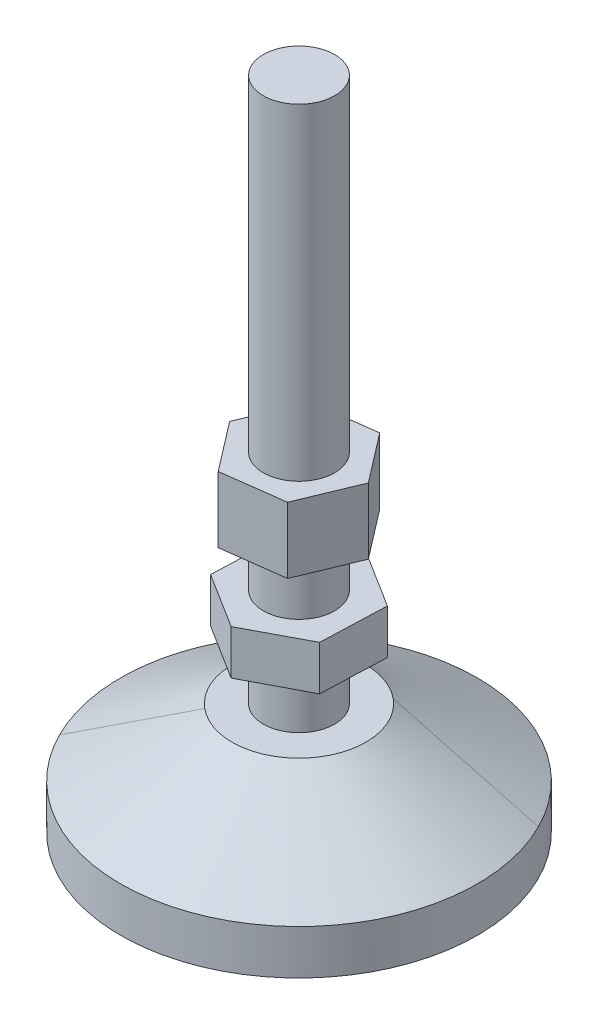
ISO-10303-21;
HEADER;
FILE_DESCRIPTION(('STEP AP214'),'2;1');
FILE_NAME('part.step','',(''),(''),'','','');
FILE_SCHEMA(('AUTOMOTIVE_DESIGN { 1 0 10303 214 1 1 1 1 }'));
ENDSEC;
DATA;
#1=APPLICATION_CONTEXT('core data for automotive mechanical design processes');
#2=APPLICATION_PROTOCOL_DEFINITION('international standard','automotive_design',2000,#1);
#3=PRODUCT_CONTEXT('',#1,'mechanical');
#4=PRODUCT('Part','Part','',(#3));
#5=PRODUCT_RELATED_PRODUCT_CATEGORY('part','',(#4));
#6=PRODUCT_DEFINITION_FORMATION('','',#4);
#7=PRODUCT_DEFINITION_CONTEXT('part definition',#1,'design');
#8=PRODUCT_DEFINITION('design','',#6,#7);
#9=PRODUCT_DEFINITION_SHAPE('','',#8);
#10=(LENGTH_UNIT() NAMED_UNIT(*) SI_UNIT(.MILLI.,.METRE.));
#11=(NAMED_UNIT(*) PLANE_ANGLE_UNIT() SI_UNIT($,.RADIAN.));
#12=(NAMED_UNIT(*) SI_UNIT($,.STERADIAN.) SOLID_ANGLE_UNIT());
#13=UNCERTAINTY_MEASURE_WITH_UNIT(LENGTH_MEASURE(1.E-05),#10,'distance_accuracy_value','');
#14=(GEOMETRIC_REPRESENTATION_CONTEXT(3) GLOBAL_UNCERTAINTY_ASSIGNED_CONTEXT((#13)) GLOBAL_UNIT_ASSIGNED_CONTEXT((#10,
#11,#12)) REPRESENTATION_CONTEXT('',''));
#15=CARTESIAN_POINT('',(0.,0.,0.));
#16=DIRECTION('',(0.,0.,1.));
#17=DIRECTION('',(1.,0.,0.));
#18=AXIS2_PLACEMENT_3D('',#15,#16,#17);
#19=CARTESIAN_POINT('',(0.,147.,0.));
#20=DIRECTION('',(0.,1.,0.));
#21=DIRECTION('',(0.,0.,-1.));
#22=AXIS2_PLACEMENT_3D('',#19,#20,#21);
#23=PLANE('',#22);
#24=CARTESIAN_POINT('',(0.,147.,0.));
#25=DIRECTION('',(0.,1.,0.));
#26=DIRECTION('',(0.,0.,1.));
#27=AXIS2_PLACEMENT_3D('',#24,#25,#26);
#28=CIRCLE('',#27,8.);
#29=CARTESIAN_POINT('',(0.,147.,-8.));
#30=VERTEX_POINT('',#29);
#31=EDGE_CURVE('E118',#30,#30,#28,.T.);
#32=ORIENTED_EDGE('',*,*,#31,.T.);
#33=EDGE_LOOP('',(#32));
#34=FACE_BOUND('',#33,.T.);
#35=ADVANCED_FACE('F15',(#34),#23,.T.);
#36=CARTESIAN_POINT('',(5.29971058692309,73.8,-12.8028538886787));
#37=DIRECTION('',(0.130751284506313,0.,0.991415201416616));
#38=DIRECTION('',(0.,-1.,0.));
#39=AXIS2_PLACEMENT_3D('',#36,#37,#38);
#40=PLANE('',#39);
#41=DIRECTION('',(-0.991415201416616,0.,0.130751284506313));
#42=VECTOR('',#41,1.);
#43=CARTESIAN_POINT('',(5.29971058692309,59.,-12.8028538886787));
#44=LINE('',#43,#42);
#45=CARTESIAN_POINT('',(5.29971058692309,59.,-12.8028538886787));
#46=VERTEX_POINT('',#45);
#47=CARTESIAN_POINT('',(-8.4377414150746,59.,-10.9911109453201));
#48=VERTEX_POINT('',#47);
#49=EDGE_CURVE('E237',#46,#48,#44,.T.);
#50=ORIENTED_EDGE('',*,*,#49,.T.);
#51=DIRECTION('',(0.,-1.,0.));
#52=VECTOR('',#51,1.);
#53=CARTESIAN_POINT('',(-8.4377414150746,73.8,-10.9911109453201));
#54=LINE('',#53,#52);
#55=CARTESIAN_POINT('',(-8.4377414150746,73.8,-10.9911109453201));
#56=VERTEX_POINT('',#55);
#57=EDGE_CURVE('E184',#56,#48,#54,.T.);
#58=ORIENTED_EDGE('',*,*,#57,.F.);
#59=DIRECTION('',(-0.991415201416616,0.,0.130751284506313));
#60=VECTOR('',#59,1.);
#61=CARTESIAN_POINT('',(5.29971058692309,73.8,-12.8028538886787));
#62=LINE('',#61,#60);
#63=CARTESIAN_POINT('',(5.29971058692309,73.8,-12.8028538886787));
#64=VERTEX_POINT('',#63);
#65=EDGE_CURVE('E174',#64,#56,#62,.T.);
#66=ORIENTED_EDGE('',*,*,#65,.F.);
#67=DIRECTION('',(0.,-1.,0.));
#68=VECTOR('',#67,1.);
#69=CARTESIAN_POINT('',(5.29971058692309,73.8,-12.8028538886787));
#70=LINE('',#69,#68);
#71=EDGE_CURVE('E9',#64,#46,#70,.T.);
#72=ORIENTED_EDGE('',*,*,#71,.T.);
#73=EDGE_LOOP('',(#50,#58,#66,#72));
#74=FACE_BOUND('',#73,.T.);
#75=ADVANCED_FACE('F426',(#74),#40,.F.);
#76=CARTESIAN_POINT('',(13.7374520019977,73.8,-1.81174294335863));
#77=DIRECTION('',(-0.793215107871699,0.,0.608941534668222));
#78=DIRECTION('',(0.,1.,0.));
#79=AXIS2_PLACEMENT_3D('',#76,#77,#78);
#80=PLANE('',#79);
#81=DIRECTION('',(-0.608941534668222,0.,-0.793215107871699));
#82=VECTOR('',#81,1.);
#83=CARTESIAN_POINT('',(13.7374520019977,59.,-1.81174294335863));
#84=LINE('',#83,#82);
#85=CARTESIAN_POINT('',(13.7374520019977,59.,-1.81174294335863));
#86=VERTEX_POINT('',#85);
#87=EDGE_CURVE('E233',#86,#46,#84,.T.);
#88=ORIENTED_EDGE('',*,*,#87,.T.);
#89=ORIENTED_EDGE('',*,*,#71,.F.);
#90=DIRECTION('',(-0.608941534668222,0.,-0.793215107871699));
#91=VECTOR('',#90,1.);
#92=CARTESIAN_POINT('',(13.7374520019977,73.8,-1.81174294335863));
#93=LINE('',#92,#91);
#94=CARTESIAN_POINT('',(13.7374520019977,73.8,-1.81174294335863));
#95=VERTEX_POINT('',#94);
#96=EDGE_CURVE('E179',#95,#64,#93,.T.);
#97=ORIENTED_EDGE('',*,*,#96,.F.);
#98=DIRECTION('',(0.,-1.,0.));
#99=VECTOR('',#98,1.);
#100=CARTESIAN_POINT('',(13.7374520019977,73.8,-1.81174294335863));
#101=LINE('',#100,#99);
#102=EDGE_CURVE('E26',#95,#86,#101,.T.);
#103=ORIENTED_EDGE('',*,*,#102,.T.);
#104=EDGE_LOOP('',(#88,#89,#97,#103));
#105=FACE_BOUND('',#104,.T.);
#106=ADVANCED_FACE('F17',(#105),#80,.F.);
#107=CARTESIAN_POINT('',(8.43774141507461,73.8,10.9911109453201));
#108=DIRECTION('',(-0.923966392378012,0.,-0.382473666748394));
#109=DIRECTION('',(-0.382473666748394,0.,0.923966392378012));
#110=AXIS2_PLACEMENT_3D('',#107,#108,#109);
#111=PLANE('',#110);
#112=DIRECTION('',(0.382473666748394,0.,-0.923966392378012));
#113=VECTOR('',#112,1.);
#114=CARTESIAN_POINT('',(8.43774141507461,59.,10.9911109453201));
#115=LINE('',#114,#113);
#116=CARTESIAN_POINT('',(8.43774141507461,59.,10.9911109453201));
#117=VERTEX_POINT('',#116);
#118=EDGE_CURVE('E208',#117,#86,#115,.T.);
#119=ORIENTED_EDGE('',*,*,#118,.T.);
#120=ORIENTED_EDGE('',*,*,#102,.F.);
#121=DIRECTION('',(0.382473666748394,0.,-0.923966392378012));
#122=VECTOR('',#121,1.);
#123=CARTESIAN_POINT('',(8.43774141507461,73.8,10.9911109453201));
#124=LINE('',#123,#122);
#125=CARTESIAN_POINT('',(8.43774141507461,73.8,10.9911109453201));
#126=VERTEX_POINT('',#125);
#127=EDGE_CURVE('E172',#126,#95,#124,.T.);
#128=ORIENTED_EDGE('',*,*,#127,.F.);
#129=DIRECTION('',(0.,-1.,0.));
#130=VECTOR('',#129,1.);
#131=CARTESIAN_POINT('',(8.43774141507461,73.8,10.9911109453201));
#132=LINE('',#131,#130);
#133=EDGE_CURVE('E232',#126,#117,#132,.T.);
#134=ORIENTED_EDGE('',*,*,#133,.T.);
#135=EDGE_LOOP('',(#119,#120,#128,#134));
#136=FACE_BOUND('',#135,.T.);
#137=ADVANCED_FACE('F615',(#136),#111,.F.);
#138=CARTESIAN_POINT('',(-5.29971058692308,73.8,12.8028538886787));
#139=DIRECTION('',(-0.130751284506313,0.,-0.991415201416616));
#140=DIRECTION('',(-0.991415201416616,0.,0.130751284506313));
#141=AXIS2_PLACEMENT_3D('',#138,#139,#140);
#142=PLANE('',#141);
#143=DIRECTION('',(0.991415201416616,0.,-0.130751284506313));
#144=VECTOR('',#143,1.);
#145=CARTESIAN_POINT('',(-5.29971058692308,59.,12.8028538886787));
#146=LINE('',#145,#144);
#147=CARTESIAN_POINT('',(-5.29971058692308,59.,12.8028538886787));
#148=VERTEX_POINT('',#147);
#149=EDGE_CURVE('E219',#148,#117,#146,.T.);
#150=ORIENTED_EDGE('',*,*,#149,.T.);
#151=ORIENTED_EDGE('',*,*,#133,.F.);
#152=DIRECTION('',(0.991415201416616,0.,-0.130751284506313));
#153=VECTOR('',#152,1.);
#154=CARTESIAN_POINT('',(-5.29971058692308,73.8,12.8028538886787));
#155=LINE('',#154,#153);
#156=CARTESIAN_POINT('',(-5.29971058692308,73.8,12.8028538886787));
#157=VERTEX_POINT('',#156);
#158=EDGE_CURVE('E168',#157,#126,#155,.T.);
#159=ORIENTED_EDGE('',*,*,#158,.F.);
#160=DIRECTION('',(0.,-1.,0.));
#161=VECTOR('',#160,1.);
#162=CARTESIAN_POINT('',(-5.29971058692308,73.8,12.8028538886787));
#163=LINE('',#162,#161);
#164=EDGE_CURVE('E41',#157,#148,#163,.T.);
#165=ORIENTED_EDGE('',*,*,#164,.T.);
#166=EDGE_LOOP('',(#150,#151,#159,#165));
#167=FACE_BOUND('',#166,.T.);
#168=ADVANCED_FACE('F619',(#167),#142,.F.);
#169=CARTESIAN_POINT('',(-13.7374520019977,73.8,1.81174294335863));
#170=DIRECTION('',(0.793215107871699,0.,-0.608941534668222));
#171=DIRECTION('',(0.,-1.,0.));
#172=AXIS2_PLACEMENT_3D('',#169,#170,#171);
#173=PLANE('',#172);
#174=DIRECTION('',(0.608941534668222,0.,0.793215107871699));
#175=VECTOR('',#174,1.);
#176=CARTESIAN_POINT('',(-13.7374520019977,59.,1.81174294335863));
#177=LINE('',#176,#175);
#178=CARTESIAN_POINT('',(-13.7374520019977,59.,1.81174294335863));
#179=VERTEX_POINT('',#178);
#180=EDGE_CURVE('E211',#179,#148,#177,.T.);
#181=ORIENTED_EDGE('',*,*,#180,.T.);
#182=ORIENTED_EDGE('',*,*,#164,.F.);
#183=DIRECTION('',(0.608941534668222,0.,0.793215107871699));
#184=VECTOR('',#183,1.);
#185=CARTESIAN_POINT('',(-13.7374520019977,73.8,1.81174294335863));
#186=LINE('',#185,#184);
#187=CARTESIAN_POINT('',(-13.7374520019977,73.8,1.81174294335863));
#188=VERTEX_POINT('',#187);
#189=EDGE_CURVE('E173',#188,#157,#186,.T.);
#190=ORIENTED_EDGE('',*,*,#189,.F.);
#191=DIRECTION('',(0.,-1.,0.));
#192=VECTOR('',#191,1.);
#193=CARTESIAN_POINT('',(-13.7374520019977,73.8,1.81174294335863));
#194=LINE('',#193,#192);
#195=EDGE_CURVE('E187',#188,#179,#194,.T.);
#196=ORIENTED_EDGE('',*,*,#195,.T.);
#197=EDGE_LOOP('',(#181,#182,#190,#196));
#198=FACE_BOUND('',#197,.T.);
#199=ADVANCED_FACE('F629',(#198),#173,.F.);
#200=CARTESIAN_POINT('',(-8.4377414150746,73.8,-10.9911109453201));
#201=DIRECTION('',(0.923966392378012,0.,0.382473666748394));
#202=DIRECTION('',(0.,-1.,0.));
#203=AXIS2_PLACEMENT_3D('',#200,#201,#202);
#204=PLANE('',#203);
#205=DIRECTION('',(-0.382473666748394,0.,0.923966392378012));
#206=VECTOR('',#205,1.);
#207=CARTESIAN_POINT('',(-8.4377414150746,59.,-10.9911109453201));
#208=LINE('',#207,#206);
#209=EDGE_CURVE('E178',#48,#179,#208,.T.);
#210=ORIENTED_EDGE('',*,*,#209,.T.);
#211=ORIENTED_EDGE('',*,*,#195,.F.);
#212=DIRECTION('',(-0.382473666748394,0.,0.923966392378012));
#213=VECTOR('',#212,1.);
#214=CARTESIAN_POINT('',(-8.4377414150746,73.8,-10.9911109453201));
#215=LINE('',#214,#213);
#216=EDGE_CURVE('E238',#56,#188,#215,.T.);
#217=ORIENTED_EDGE('',*,*,#216,.F.);
#218=ORIENTED_EDGE('',*,*,#57,.T.);
#219=EDGE_LOOP('',(#210,#211,#217,#218));
#220=FACE_BOUND('',#219,.T.);
#221=ADVANCED_FACE('F602',(#220),#204,.F.);
#222=CARTESIAN_POINT('',(0.,59.,0.));
#223=DIRECTION('',(0.,1.,0.));
#224=DIRECTION('',(1.,0.,0.));
#225=AXIS2_PLACEMENT_3D('',#222,#223,#224);
#226=PLANE('',#225);
#227=CARTESIAN_POINT('',(0.,59.,0.));
#228=DIRECTION('',(0.,1.,0.));
#229=DIRECTION('',(0.,0.,1.));
#230=AXIS2_PLACEMENT_3D('',#227,#228,#229);
#231=CIRCLE('',#230,8.);
#232=CARTESIAN_POINT('',(0.,59.,-8.));
#233=VERTEX_POINT('',#232);
#234=EDGE_CURVE('E143',#233,#233,#231,.T.);
#235=ORIENTED_EDGE('',*,*,#234,.T.);
#236=EDGE_LOOP('',(#235));
#237=FACE_BOUND('',#236,.T.);
#238=ORIENTED_EDGE('',*,*,#209,.F.);
#239=ORIENTED_EDGE('',*,*,#49,.F.);
#240=ORIENTED_EDGE('',*,*,#87,.F.);
#241=ORIENTED_EDGE('',*,*,#118,.F.);
#242=ORIENTED_EDGE('',*,*,#149,.F.);
#243=ORIENTED_EDGE('',*,*,#180,.F.);
#244=EDGE_LOOP('',(#238,#239,#240,#241,#242,#243));
#245=FACE_BOUND('',#244,.T.);
#246=ADVANCED_FACE('F598',(#237,#245),#226,.F.);
#247=CARTESIAN_POINT('',(0.,73.8,0.));
#248=DIRECTION('',(0.,1.,0.));
#249=DIRECTION('',(1.,0.,0.));
#250=AXIS2_PLACEMENT_3D('',#247,#248,#249);
#251=PLANE('',#250);
#252=CARTESIAN_POINT('',(0.,73.8,0.));
#253=DIRECTION('',(0.,1.,0.));
#254=DIRECTION('',(0.,0.,1.));
#255=AXIS2_PLACEMENT_3D('',#252,#253,#254);
#256=CIRCLE('',#255,8.);
#257=CARTESIAN_POINT('',(0.,73.8,-8.));
#258=VERTEX_POINT('',#257);
#259=EDGE_CURVE('E112',#258,#258,#256,.T.);
#260=ORIENTED_EDGE('',*,*,#259,.F.);
#261=EDGE_LOOP('',(#260));
#262=FACE_BOUND('',#261,.T.);
#263=ORIENTED_EDGE('',*,*,#216,.T.);
#264=ORIENTED_EDGE('',*,*,#189,.T.);
#265=ORIENTED_EDGE('',*,*,#158,.T.);
#266=ORIENTED_EDGE('',*,*,#127,.T.);
#267=ORIENTED_EDGE('',*,*,#96,.T.);
#268=ORIENTED_EDGE('',*,*,#65,.T.);
#269=EDGE_LOOP('',(#263,#264,#265,#266,#267,#268));
#270=FACE_BOUND('',#269,.T.);
#271=ADVANCED_FACE('F442',(#262,#270),#251,.T.);
#272=CARTESIAN_POINT('',(0.,37.,0.));
#273=DIRECTION('',(0.,1.,0.));
#274=DIRECTION('',(1.,0.,0.));
#275=AXIS2_PLACEMENT_3D('',#272,#273,#274);
#276=PLANE('',#275);
#277=CARTESIAN_POINT('',(0.,37.,0.));
#278=DIRECTION('',(0.,1.,0.));
#279=DIRECTION('',(0.,0.,1.));
#280=AXIS2_PLACEMENT_3D('',#277,#278,#279);
#281=CIRCLE('',#280,8.);
#282=CARTESIAN_POINT('',(0.,37.,-8.));
#283=VERTEX_POINT('',#282);
#284=EDGE_CURVE('E144',#283,#283,#281,.T.);
#285=ORIENTED_EDGE('',*,*,#284,.T.);
#286=EDGE_LOOP('',(#285));
#287=FACE_BOUND('',#286,.T.);
#288=DIRECTION('',(-0.884080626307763,0.,0.467334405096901));
#289=VECTOR('',#288,1.);
#290=CARTESIAN_POINT('',(0.547240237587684,37.,-14.6544826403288));
#291=LINE('',#290,#289);
#292=CARTESIAN_POINT('',(0.547240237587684,37.,-14.6544826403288));
#293=VERTEX_POINT('',#292);
#294=CARTESIAN_POINT('',(-12.417534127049,37.,-7.80116526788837));
#295=VERTEX_POINT('',#294);
#296=EDGE_CURVE('E154',#293,#295,#291,.T.);
#297=ORIENTED_EDGE('',*,*,#296,.F.);
#298=DIRECTION('',(-0.846763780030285,0.,-0.53196907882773));
#299=VECTOR('',#298,1.);
#300=CARTESIAN_POINT('',(12.9647743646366,37.,-6.85331737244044));
#301=LINE('',#300,#299);
#302=CARTESIAN_POINT('',(12.9647743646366,37.,-6.85331737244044));
#303=VERTEX_POINT('',#302);
#304=EDGE_CURVE('E271',#303,#293,#301,.T.);
#305=ORIENTED_EDGE('',*,*,#304,.F.);
#306=DIRECTION('',(0.0373168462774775,0.,-0.99930348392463));
#307=VECTOR('',#306,1.);
#308=CARTESIAN_POINT('',(12.417534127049,37.,7.80116526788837));
#309=LINE('',#308,#307);
#310=CARTESIAN_POINT('',(12.417534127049,37.,7.80116526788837));
#311=VERTEX_POINT('',#310);
#312=EDGE_CURVE('E161',#311,#303,#309,.T.);
#313=ORIENTED_EDGE('',*,*,#312,.F.);
#314=DIRECTION('',(0.884080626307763,0.,-0.467334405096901));
#315=VECTOR('',#314,1.);
#316=CARTESIAN_POINT('',(-0.547240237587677,37.,14.6544826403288));
#317=LINE('',#316,#315);
#318=CARTESIAN_POINT('',(-0.547240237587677,37.,14.6544826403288));
#319=VERTEX_POINT('',#318);
#320=EDGE_CURVE('E325',#319,#311,#317,.T.);
#321=ORIENTED_EDGE('',*,*,#320,.F.);
#322=DIRECTION('',(0.846763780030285,0.,0.531969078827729));
#323=VECTOR('',#322,1.);
#324=CARTESIAN_POINT('',(-12.9647743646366,37.,6.85331737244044));
#325=LINE('',#324,#323);
#326=CARTESIAN_POINT('',(-12.9647743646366,37.,6.85331737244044));
#327=VERTEX_POINT('',#326);
#328=EDGE_CURVE('E145',#327,#319,#325,.T.);
#329=ORIENTED_EDGE('',*,*,#328,.F.);
#330=DIRECTION('',(-0.0373168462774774,0.,0.99930348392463));
#331=VECTOR('',#330,1.);
#332=CARTESIAN_POINT('',(-12.417534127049,37.,-7.80116526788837));
#333=LINE('',#332,#331);
#334=EDGE_CURVE('E190',#295,#327,#333,.T.);
#335=ORIENTED_EDGE('',*,*,#334,.F.);
#336=EDGE_LOOP('',(#297,#305,#313,#321,#329,#335));
#337=FACE_BOUND('',#336,.T.);
#338=ADVANCED_FACE('F409',(#287,#337),#276,.F.);
#339=CARTESIAN_POINT('',(0.,47.,0.));
#340=DIRECTION('',(0.,1.,0.));
#341=DIRECTION('',(1.,0.,0.));
#342=AXIS2_PLACEMENT_3D('',#339,#340,#341);
#343=PLANE('',#342);
#344=CARTESIAN_POINT('',(0.,47.,0.));
#345=DIRECTION('',(0.,1.,0.));
#346=DIRECTION('',(0.,0.,1.));
#347=AXIS2_PLACEMENT_3D('',#344,#345,#346);
#348=CIRCLE('',#347,8.);
#349=CARTESIAN_POINT('',(0.,47.,-8.));
#350=VERTEX_POINT('',#349);
#351=EDGE_CURVE('E167',#350,#350,#348,.T.);
#352=ORIENTED_EDGE('',*,*,#351,.F.);
#353=EDGE_LOOP('',(#352));
#354=FACE_BOUND('',#353,.T.);
#355=DIRECTION('',(-0.884080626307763,0.,0.467334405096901));
#356=VECTOR('',#355,1.);
#357=CARTESIAN_POINT('',(0.547240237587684,47.,-14.6544826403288));
#358=LINE('',#357,#356);
#359=CARTESIAN_POINT('',(0.547240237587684,47.,-14.6544826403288));
#360=VERTEX_POINT('',#359);
#361=CARTESIAN_POINT('',(-12.417534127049,47.,-7.80116526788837));
#362=VERTEX_POINT('',#361);
#363=EDGE_CURVE('E135',#360,#362,#358,.T.);
#364=ORIENTED_EDGE('',*,*,#363,.T.);
#365=DIRECTION('',(-0.0373168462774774,0.,0.99930348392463));
#366=VECTOR('',#365,1.);
#367=CARTESIAN_POINT('',(-12.417534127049,47.,-7.80116526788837));
#368=LINE('',#367,#366);
#369=CARTESIAN_POINT('',(-12.9647743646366,47.,6.85331737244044));
#370=VERTEX_POINT('',#369);
#371=EDGE_CURVE('E150',#362,#370,#368,.T.);
#372=ORIENTED_EDGE('',*,*,#371,.T.);
#373=DIRECTION('',(0.846763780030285,0.,0.531969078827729));
#374=VECTOR('',#373,1.);
#375=CARTESIAN_POINT('',(-12.9647743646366,47.,6.85331737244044));
#376=LINE('',#375,#374);
#377=CARTESIAN_POINT('',(-0.547240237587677,47.,14.6544826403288));
#378=VERTEX_POINT('',#377);
#379=EDGE_CURVE('E19',#370,#378,#376,.T.);
#380=ORIENTED_EDGE('',*,*,#379,.T.);
#381=DIRECTION('',(0.884080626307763,0.,-0.467334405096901));
#382=VECTOR('',#381,1.);
#383=CARTESIAN_POINT('',(-0.547240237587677,47.,14.6544826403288));
#384=LINE('',#383,#382);
#385=CARTESIAN_POINT('',(12.417534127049,47.,7.80116526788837));
#386=VERTEX_POINT('',#385);
#387=EDGE_CURVE('E158',#378,#386,#384,.T.);
#388=ORIENTED_EDGE('',*,*,#387,.T.);
#389=DIRECTION('',(0.0373168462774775,0.,-0.99930348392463));
#390=VECTOR('',#389,1.);
#391=CARTESIAN_POINT('',(12.417534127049,47.,7.80116526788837));
#392=LINE('',#391,#390);
#393=CARTESIAN_POINT('',(12.9647743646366,47.,-6.85331737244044));
#394=VERTEX_POINT('',#393);
#395=EDGE_CURVE('E279',#386,#394,#392,.T.);
#396=ORIENTED_EDGE('',*,*,#395,.T.);
#397=DIRECTION('',(-0.846763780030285,0.,-0.53196907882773));
#398=VECTOR('',#397,1.);
#399=CARTESIAN_POINT('',(12.9647743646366,47.,-6.85331737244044));
#400=LINE('',#399,#398);
#401=EDGE_CURVE('E241',#394,#360,#400,.T.);
#402=ORIENTED_EDGE('',*,*,#401,.T.);
#403=EDGE_LOOP('',(#364,#372,#380,#388,#396,#402));
#404=FACE_BOUND('',#403,.T.);
#405=ADVANCED_FACE('F340',(#354,#404),#343,.T.);
#406=CARTESIAN_POINT('',(12.9647743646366,47.,-6.85331737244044));
#407=DIRECTION('',(-0.53196907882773,0.,0.846763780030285));
#408=DIRECTION('',(0.,1.,0.));
#409=AXIS2_PLACEMENT_3D('',#406,#407,#408);
#410=PLANE('',#409);
#411=ORIENTED_EDGE('',*,*,#304,.T.);
#412=DIRECTION('',(0.,-1.,0.));
#413=VECTOR('',#412,1.);
#414=CARTESIAN_POINT('',(0.547240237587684,47.,-14.6544826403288));
#415=LINE('',#414,#413);
#416=EDGE_CURVE('E138',#360,#293,#415,.T.);
#417=ORIENTED_EDGE('',*,*,#416,.F.);
#418=ORIENTED_EDGE('',*,*,#401,.F.);
#419=DIRECTION('',(0.,-1.,0.));
#420=VECTOR('',#419,1.);
#421=CARTESIAN_POINT('',(12.9647743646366,47.,-6.85331737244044));
#422=LINE('',#421,#420);
#423=EDGE_CURVE('E283',#394,#303,#422,.T.);
#424=ORIENTED_EDGE('',*,*,#423,.T.);
#425=EDGE_LOOP('',(#411,#417,#418,#424));
#426=FACE_BOUND('',#425,.T.);
#427=ADVANCED_FACE('F408',(#426),#410,.F.);
#428=CARTESIAN_POINT('',(12.417534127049,47.,7.80116526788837));
#429=DIRECTION('',(-0.99930348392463,0.,-0.0373168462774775));
#430=DIRECTION('',(-0.0373168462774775,0.,0.99930348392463));
#431=AXIS2_PLACEMENT_3D('',#428,#429,#430);
#432=PLANE('',#431);
#433=ORIENTED_EDGE('',*,*,#312,.T.);
#434=ORIENTED_EDGE('',*,*,#423,.F.);
#435=ORIENTED_EDGE('',*,*,#395,.F.);
#436=DIRECTION('',(0.,-1.,0.));
#437=VECTOR('',#436,1.);
#438=CARTESIAN_POINT('',(12.417534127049,47.,7.80116526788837));
#439=LINE('',#438,#437);
#440=EDGE_CURVE('E162',#386,#311,#439,.T.);
#441=ORIENTED_EDGE('',*,*,#440,.T.);
#442=EDGE_LOOP('',(#433,#434,#435,#441));
#443=FACE_BOUND('',#442,.T.);
#444=ADVANCED_FACE('F413',(#443),#432,.F.);
#445=CARTESIAN_POINT('',(-0.547240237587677,47.,14.6544826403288));
#446=DIRECTION('',(-0.467334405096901,0.,-0.884080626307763));
#447=DIRECTION('',(-0.884080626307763,0.,0.467334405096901));
#448=AXIS2_PLACEMENT_3D('',#445,#446,#447);
#449=PLANE('',#448);
#450=ORIENTED_EDGE('',*,*,#320,.T.);
#451=ORIENTED_EDGE('',*,*,#440,.F.);
#452=ORIENTED_EDGE('',*,*,#387,.F.);
#453=DIRECTION('',(0.,-1.,0.));
#454=VECTOR('',#453,1.);
#455=CARTESIAN_POINT('',(-0.547240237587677,47.,14.6544826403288));
#456=LINE('',#455,#454);
#457=EDGE_CURVE('E149',#378,#319,#456,.T.);
#458=ORIENTED_EDGE('',*,*,#457,.T.);
#459=EDGE_LOOP('',(#450,#451,#452,#458));
#460=FACE_BOUND('',#459,.T.);
#461=ADVANCED_FACE('F344',(#460),#449,.F.);
#462=CARTESIAN_POINT('',(-12.9647743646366,47.,6.85331737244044));
#463=DIRECTION('',(0.531969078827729,0.,-0.846763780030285));
#464=DIRECTION('',(0.,-1.,0.));
#465=AXIS2_PLACEMENT_3D('',#462,#463,#464);
#466=PLANE('',#465);
#467=ORIENTED_EDGE('',*,*,#328,.T.);
#468=ORIENTED_EDGE('',*,*,#457,.F.);
#469=ORIENTED_EDGE('',*,*,#379,.F.);
#470=DIRECTION('',(0.,-1.,0.));
#471=VECTOR('',#470,1.);
#472=CARTESIAN_POINT('',(-12.9647743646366,47.,6.85331737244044));
#473=LINE('',#472,#471);
#474=EDGE_CURVE('E183',#370,#327,#473,.T.);
#475=ORIENTED_EDGE('',*,*,#474,.T.);
#476=EDGE_LOOP('',(#467,#468,#469,#475));
#477=FACE_BOUND('',#476,.T.);
#478=ADVANCED_FACE('F343',(#477),#466,.F.);
#479=CARTESIAN_POINT('',(-12.417534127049,47.,-7.80116526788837));
#480=DIRECTION('',(0.99930348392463,0.,0.0373168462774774));
#481=DIRECTION('',(0.,-1.,0.));
#482=AXIS2_PLACEMENT_3D('',#479,#480,#481);
#483=PLANE('',#482);
#484=ORIENTED_EDGE('',*,*,#334,.T.);
#485=ORIENTED_EDGE('',*,*,#474,.F.);
#486=ORIENTED_EDGE('',*,*,#371,.F.);
#487=DIRECTION('',(0.,-1.,0.));
#488=VECTOR('',#487,1.);
#489=CARTESIAN_POINT('',(-12.417534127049,47.,-7.80116526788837));
#490=LINE('',#489,#488);
#491=EDGE_CURVE('E139',#362,#295,#490,.T.);
#492=ORIENTED_EDGE('',*,*,#491,.T.);
#493=EDGE_LOOP('',(#484,#485,#486,#492));
#494=FACE_BOUND('',#493,.T.);
#495=ADVANCED_FACE('F412',(#494),#483,.F.);
#496=CARTESIAN_POINT('',(0.547240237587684,47.,-14.6544826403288));
#497=DIRECTION('',(0.467334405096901,0.,0.884080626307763));
#498=DIRECTION('',(0.,-1.,0.));
#499=AXIS2_PLACEMENT_3D('',#496,#497,#498);
#500=PLANE('',#499);
#501=ORIENTED_EDGE('',*,*,#296,.T.);
#502=ORIENTED_EDGE('',*,*,#491,.F.);
#503=ORIENTED_EDGE('',*,*,#363,.F.);
#504=ORIENTED_EDGE('',*,*,#416,.T.);
#505=EDGE_LOOP('',(#501,#502,#503,#504));
#506=FACE_BOUND('',#505,.T.);
#507=ADVANCED_FACE('F411',(#506),#500,.F.);
#508=CARTESIAN_POINT('',(9.59513522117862,25.,-11.529673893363));
#509=CARTESIAN_POINT('',(35.7610540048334,10.,-17.9205752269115));
#510=CARTESIAN_POINT('',(9.59596431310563,25.,-11.5289839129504));
#511=CARTESIAN_POINT('',(35.762342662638,10.,-17.9180036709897));
#512=CARTESIAN_POINT('',(9.59679330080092,25.,-11.5282938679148));
#513=CARTESIAN_POINT('',(35.7636309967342,10.,-17.9154320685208));
#514=CARTESIAN_POINT('',(9.59762218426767,25.,-11.5276037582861));
#515=CARTESIAN_POINT('',(35.7649190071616,10.,-17.9128604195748));
#516=CARTESIAN_POINT('',(32.65282970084,25.,7.66764061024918));
#517=CARTESIAN_POINT('',(71.5906398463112,10.,53.6169775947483));
#518=CARTESIAN_POINT('',(13.4575853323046,25.,30.7228481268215));
#519=CARTESIAN_POINT('',(0.0608018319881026,10.,89.442698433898));
#520=CARTESIAN_POINT('',(-9.59762218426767,25.,11.5276037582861));
#521=CARTESIAN_POINT('',(-35.7649190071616,10.,17.9128604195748));
#522=CARTESIAN_POINT('',(-9.59845106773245,25.,11.5269136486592));
#523=CARTESIAN_POINT('',(-35.7662070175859,10.,17.910288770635));
#524=CARTESIAN_POINT('',(-9.59927990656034,25.,11.5262234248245));
#525=CARTESIAN_POINT('',(-35.7674947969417,10.,17.9077168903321));
#526=CARTESIAN_POINT('',(-9.60010870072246,25.,11.5255330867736));
#527=CARTESIAN_POINT('',(-35.7687823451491,10.,17.9051447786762));
#528=(BOUNDED_SURFACE() B_SPLINE_SURFACE(3,1,((#508,#509),(#510,#511),(#512,#513),(#514,#515),
(#516,#517),(#518,#519),(#520,#521),(#522,#523),(#524,#525),(#526,#527)),.UNSPECIFIED.,.F.,.F.,
.F.) B_SPLINE_SURFACE_WITH_KNOTS((4,3,3,4),(2,2),(0.499946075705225,0.5,1.,1.00005392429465),
(0.,1.),
.UNSPECIFIED.) GEOMETRIC_REPRESENTATION_ITEM() RATIONAL_B_SPLINE_SURFACE(((0.999784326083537,
0.999784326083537),(0.999856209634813,0.999856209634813),(0.9999281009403,0.9999281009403),(1.,
1.),(0.333333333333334,0.333333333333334),(0.333333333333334,0.333333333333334),(1.,1.),
(0.999928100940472,0.999928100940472),(0.999856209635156,0.999856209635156),(0.999784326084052,0.999784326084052))) REPRESENTATION_ITEM('') SURFACE());
#529=CARTESIAN_POINT('',(9.59762147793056,25.,-11.5276029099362));
#530=CARTESIAN_POINT('',(35.7649190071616,10.,-17.9128604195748));
#531=(BOUNDED_CURVE() B_SPLINE_CURVE(1,(#529,#530),.UNSPECIFIED.,.F.,
.F.) B_SPLINE_CURVE_WITH_KNOTS((2,2),(0.,1.),
.UNSPECIFIED.) CURVE() GEOMETRIC_REPRESENTATION_ITEM() RATIONAL_B_SPLINE_CURVE((1.,1.)) REPRESENTATION_ITEM(''));
#532=CARTESIAN_POINT('',(9.59762147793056,25.,-11.5276029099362));
#533=VERTEX_POINT('',#532);
#534=CARTESIAN_POINT('',(35.7649190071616,10.,-17.9128604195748));
#535=VERTEX_POINT('',#534);
#536=EDGE_CURVE('E126',#533,#535,#531,.T.);
#537=CARTESIAN_POINT('',(0.,25.,0.));
#538=DIRECTION('',(0.,1.,0.));
#539=DIRECTION('',(0.,0.,1.));
#540=AXIS2_PLACEMENT_3D('',#537,#538,#539);
#541=CIRCLE('',#540,15.);
#542=CARTESIAN_POINT('',(-9.59762147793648,25.,11.5276029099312));
#543=VERTEX_POINT('',#542);
#544=EDGE_CURVE('E164',#543,#533,#541,.T.);
#545=CARTESIAN_POINT('',(-9.59762147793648,25.,11.5276029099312));
#546=CARTESIAN_POINT('',(-35.7649190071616,10.,17.9128604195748));
#547=(BOUNDED_CURVE() B_SPLINE_CURVE(1,(#545,#546),.UNSPECIFIED.,.F.,
.F.) B_SPLINE_CURVE_WITH_KNOTS((2,2),(0.,1.),
.UNSPECIFIED.) CURVE() GEOMETRIC_REPRESENTATION_ITEM() RATIONAL_B_SPLINE_CURVE((1.,1.)) REPRESENTATION_ITEM(''));
#548=CARTESIAN_POINT('',(-35.7649190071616,10.,17.9128604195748));
#549=VERTEX_POINT('',#548);
#550=EDGE_CURVE('E274',#543,#549,#547,.T.);
#551=CARTESIAN_POINT('',(0.,10.,0.));
#552=DIRECTION('',(0.,1.,0.));
#553=DIRECTION('',(0.,0.,-1.));
#554=AXIS2_PLACEMENT_3D('',#551,#552,#553);
#555=CIRCLE('',#554,40.);
#556=EDGE_CURVE('E267',#549,#535,#555,.T.);
#557=ORIENTED_EDGE('',*,*,#536,.F.);
#558=ORIENTED_EDGE('',*,*,#544,.F.);
#559=ORIENTED_EDGE('',*,*,#550,.T.);
#560=ORIENTED_EDGE('',*,*,#556,.T.);
#561=EDGE_LOOP('',(#557,#558,#559,#560));
#562=FACE_BOUND('',#561,.T.);
#563=ADVANCED_FACE('F571',(#562),#528,.T.);
#564=CARTESIAN_POINT('',(0.,25.,0.));
#565=DIRECTION('',(0.,1.,0.));
#566=DIRECTION('',(1.,0.,0.));
#567=AXIS2_PLACEMENT_3D('',#564,#565,#566);
#568=PLANE('',#567);
#569=CARTESIAN_POINT('',(0.,25.,0.));
#570=DIRECTION('',(0.,1.,0.));
#571=DIRECTION('',(0.,0.,1.));
#572=AXIS2_PLACEMENT_3D('',#569,#570,#571);
#573=CIRCLE('',#572,8.);
#574=CARTESIAN_POINT('',(0.,25.,-8.));
#575=VERTEX_POINT('',#574);
#576=EDGE_CURVE('E140',#575,#575,#573,.T.);
#577=ORIENTED_EDGE('',*,*,#576,.F.);
#578=EDGE_LOOP('',(#577));
#579=FACE_BOUND('',#578,.T.);
#580=ORIENTED_EDGE('',*,*,#544,.T.);
#581=CARTESIAN_POINT('',(0.,25.,0.));
#582=DIRECTION('',(0.,1.,0.));
#583=DIRECTION('',(0.,0.,1.));
#584=AXIS2_PLACEMENT_3D('',#581,#582,#583);
#585=CIRCLE('',#584,15.);
#586=EDGE_CURVE('E117',#533,#543,#585,.T.);
#587=ORIENTED_EDGE('',*,*,#586,.T.);
#588=EDGE_LOOP('',(#580,#587));
#589=FACE_BOUND('',#588,.T.);
#590=ADVANCED_FACE('F567',(#579,#589),#568,.T.);
#591=CARTESIAN_POINT('',(0.,0.,0.));
#592=DIRECTION('',(0.,1.,0.));
#593=DIRECTION('',(1.,0.,0.));
#594=AXIS2_PLACEMENT_3D('',#591,#592,#593);
#595=PLANE('',#594);
#596=CARTESIAN_POINT('',(0.,0.,0.));
#597=DIRECTION('',(0.,1.,0.));
#598=DIRECTION('',(0.,0.,1.));
#599=AXIS2_PLACEMENT_3D('',#596,#597,#598);
#600=CIRCLE('',#599,40.);
#601=CARTESIAN_POINT('',(0.,0.,-40.));
#602=VERTEX_POINT('',#601);
#603=EDGE_CURVE('E264',#602,#602,#600,.T.);
#604=ORIENTED_EDGE('',*,*,#603,.F.);
#605=EDGE_LOOP('',(#604));
#606=FACE_BOUND('',#605,.T.);
#607=ADVANCED_FACE('F453',(#606),#595,.F.);
#608=CARTESIAN_POINT('',(0.,69.6274169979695,0.));
#609=DIRECTION('',(0.,-1.,0.));
#610=DIRECTION('',(0.,0.,-1.));
#611=AXIS2_PLACEMENT_3D('',#608,#609,#610);
#612=CYLINDRICAL_SURFACE('',#611,8.);
#613=ORIENTED_EDGE('',*,*,#351,.T.);
#614=EDGE_LOOP('',(#613));
#615=FACE_BOUND('',#614,.T.);
#616=ORIENTED_EDGE('',*,*,#234,.F.);
#617=EDGE_LOOP('',(#616));
#618=FACE_BOUND('',#617,.T.);
#619=ADVANCED_FACE('F446',(#615,#618),#612,.T.);
#620=CARTESIAN_POINT('',(0.,69.6274169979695,0.));
#621=DIRECTION('',(0.,-1.,0.));
#622=DIRECTION('',(0.,0.,-1.));
#623=AXIS2_PLACEMENT_3D('',#620,#621,#622);
#624=CYLINDRICAL_SURFACE('',#623,8.);
#625=ORIENTED_EDGE('',*,*,#576,.T.);
#626=EDGE_LOOP('',(#625));
#627=FACE_BOUND('',#626,.T.);
#628=ORIENTED_EDGE('',*,*,#284,.F.);
#629=EDGE_LOOP('',(#628));
#630=FACE_BOUND('',#629,.T.);
#631=ADVANCED_FACE('F444',(#627,#630),#624,.T.);
#632=CARTESIAN_POINT('',(0.,10.,0.));
#633=DIRECTION('',(0.,-1.,0.));
#634=DIRECTION('',(0.,0.,-1.));
#635=AXIS2_PLACEMENT_3D('',#632,#633,#634);
#636=CYLINDRICAL_SURFACE('',#635,40.);
#637=ORIENTED_EDGE('',*,*,#603,.T.);
#638=EDGE_LOOP('',(#637));
#639=FACE_BOUND('',#638,.T.);
#640=CARTESIAN_POINT('',(0.,10.,0.));
#641=DIRECTION('',(0.,1.,0.));
#642=DIRECTION('',(0.,0.,-1.));
#643=AXIS2_PLACEMENT_3D('',#640,#641,#642);
#644=CIRCLE('',#643,40.);
#645=EDGE_CURVE('E291',#535,#549,#644,.T.);
#646=ORIENTED_EDGE('',*,*,#645,.F.);
#647=ORIENTED_EDGE('',*,*,#556,.F.);
#648=EDGE_LOOP('',(#646,#647));
#649=FACE_BOUND('',#648,.T.);
#650=ADVANCED_FACE('F436',(#639,#649),#636,.T.);
#651=CARTESIAN_POINT('',(-9.5951352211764,25.,11.5296738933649));
#652=CARTESIAN_POINT('',(-35.7610540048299,10.,17.9205752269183));
#653=CARTESIAN_POINT('',(-9.59596431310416,25.,11.5289839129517));
#654=CARTESIAN_POINT('',(-35.7623426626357,10.,17.9180036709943));
#655=CARTESIAN_POINT('',(-9.59679330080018,25.,11.5282938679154));
#656=CARTESIAN_POINT('',(-35.763630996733,10.,17.9154320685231));
#657=CARTESIAN_POINT('',(-9.59762218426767,25.,11.5276037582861));
#658=CARTESIAN_POINT('',(-35.7649190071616,10.,17.9128604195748));
#659=CARTESIAN_POINT('',(-32.65282970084,25.,-7.66764061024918));
#660=CARTESIAN_POINT('',(-71.5906398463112,10.,-53.6169775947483));
#661=CARTESIAN_POINT('',(-13.4575853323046,25.,-30.7228481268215));
#662=CARTESIAN_POINT('',(-0.0608018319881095,10.,-89.442698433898));
#663=CARTESIAN_POINT('',(9.59762218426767,25.,-11.5276037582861));
#664=CARTESIAN_POINT('',(35.7649190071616,10.,-17.9128604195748));
#665=CARTESIAN_POINT('',(9.5984510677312,25.,-11.5269136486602));
#666=CARTESIAN_POINT('',(35.766207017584,10.,-17.9102887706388));
#667=CARTESIAN_POINT('',(9.59927990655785,25.,-11.5262234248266));
#668=CARTESIAN_POINT('',(35.7674947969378,10.,-17.9077168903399));
#669=CARTESIAN_POINT('',(9.60010870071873,25.,-11.5255330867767));
#670=CARTESIAN_POINT('',(35.7687823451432,10.,-17.9051447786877));
#671=(BOUNDED_SURFACE() B_SPLINE_SURFACE(3,1,((#651,#652),(#653,#654),(#655,#656),(#657,#658),
(#659,#660),(#661,#662),(#663,#664),(#665,#666),(#667,#668),(#669,#670)),.UNSPECIFIED.,.F.,.F.,
.F.) B_SPLINE_SURFACE_WITH_KNOTS((4,3,3,4),(2,2),(-5.39242948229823E-05,0.,0.5,
0.500053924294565),(0.,1.),
.UNSPECIFIED.) GEOMETRIC_REPRESENTATION_ITEM() RATIONAL_B_SPLINE_SURFACE(((0.999784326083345,
0.999784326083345),(0.999856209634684,0.999856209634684),(0.999928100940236,0.999928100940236),
(1.,1.),(0.333333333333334,0.333333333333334),(0.333333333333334,0.333333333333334),(1.,1.),
(0.99992810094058,0.99992810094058),(0.999856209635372,0.999856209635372),(0.999784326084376,0.999784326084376))) REPRESENTATION_ITEM('') SURFACE());
#672=ORIENTED_EDGE('',*,*,#586,.F.);
#673=ORIENTED_EDGE('',*,*,#536,.T.);
#674=ORIENTED_EDGE('',*,*,#645,.T.);
#675=ORIENTED_EDGE('',*,*,#550,.F.);
#676=EDGE_LOOP('',(#672,#673,#674,#675));
#677=FACE_BOUND('',#676,.T.);
#678=ADVANCED_FACE('F439',(#677),#671,.T.);
#679=CARTESIAN_POINT('',(0.,69.6274169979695,0.));
#680=DIRECTION('',(0.,-1.,0.));
#681=DIRECTION('',(0.,0.,-1.));
#682=AXIS2_PLACEMENT_3D('',#679,#680,#681);
#683=CYLINDRICAL_SURFACE('',#682,8.);
#684=ORIENTED_EDGE('',*,*,#259,.T.);
#685=EDGE_LOOP('',(#684));
#686=FACE_BOUND('',#685,.T.);
#687=ORIENTED_EDGE('',*,*,#31,.F.);
#688=EDGE_LOOP('',(#687));
#689=FACE_BOUND('',#688,.T.);
#690=ADVANCED_FACE('F113',(#686,#689),#683,.T.);
#691=CLOSED_SHELL('',(#35,#75,#106,#137,#168,#199,#221,#246,#271,#338,#405,#427,#444,#461,#478,
#495,#507,#563,#590,#607,#619,#631,#650,#678,#690));
#692=MANIFOLD_SOLID_BREP('B1',#691);
#693=ADVANCED_BREP_SHAPE_REPRESENTATION('',(#18,#692),#14);
#694=SHAPE_DEFINITION_REPRESENTATION(#9,#693);
ENDSEC;
END-ISO-10303-21;
